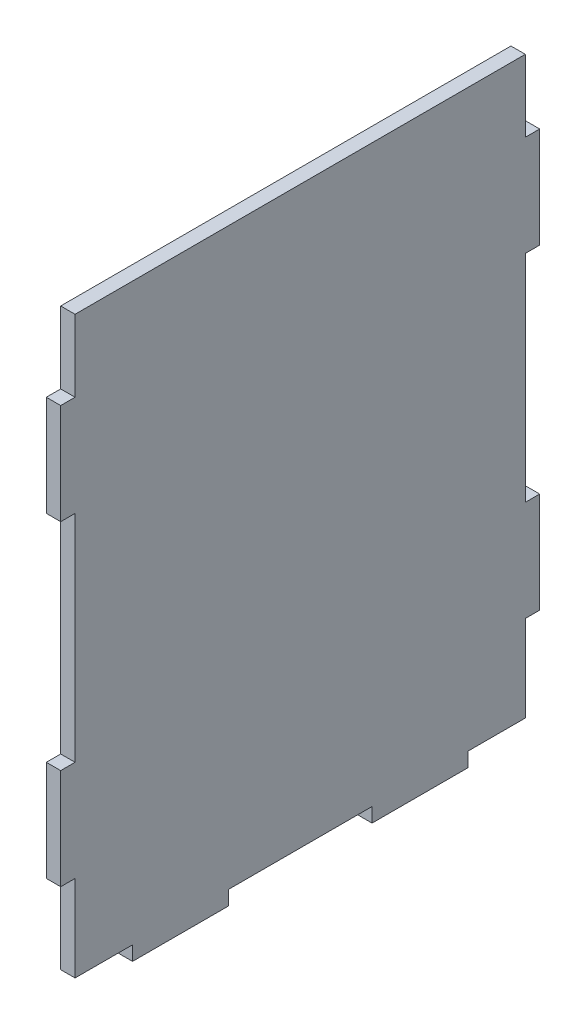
ISO-10303-21;
HEADER;
FILE_DESCRIPTION(('STEP AP214'),'2;1');
FILE_NAME('part.step','',(''),(''),'','','');
FILE_SCHEMA(('AUTOMOTIVE_DESIGN { 1 0 10303 214 1 1 1 1 }'));
ENDSEC;
DATA;
#1=APPLICATION_CONTEXT('core data for automotive mechanical design processes');
#2=APPLICATION_PROTOCOL_DEFINITION('international standard','automotive_design',2000,#1);
#3=PRODUCT_CONTEXT('',#1,'mechanical');
#4=PRODUCT('Part','Part','',(#3));
#5=PRODUCT_RELATED_PRODUCT_CATEGORY('part','',(#4));
#6=PRODUCT_DEFINITION_FORMATION('','',#4);
#7=PRODUCT_DEFINITION_CONTEXT('part definition',#1,'design');
#8=PRODUCT_DEFINITION('design','',#6,#7);
#9=PRODUCT_DEFINITION_SHAPE('','',#8);
#10=(LENGTH_UNIT() NAMED_UNIT(*) SI_UNIT(.MILLI.,.METRE.));
#11=(NAMED_UNIT(*) PLANE_ANGLE_UNIT() SI_UNIT($,.RADIAN.));
#12=(NAMED_UNIT(*) SI_UNIT($,.STERADIAN.) SOLID_ANGLE_UNIT());
#13=UNCERTAINTY_MEASURE_WITH_UNIT(LENGTH_MEASURE(1.E-05),#10,'distance_accuracy_value','');
#14=(GEOMETRIC_REPRESENTATION_CONTEXT(3) GLOBAL_UNCERTAINTY_ASSIGNED_CONTEXT((#13)) GLOBAL_UNIT_ASSIGNED_CONTEXT((#10,
#11,#12)) REPRESENTATION_CONTEXT('',''));
#15=CARTESIAN_POINT('',(0.,0.,0.));
#16=DIRECTION('',(0.,0.,1.));
#17=DIRECTION('',(1.,0.,0.));
#18=AXIS2_PLACEMENT_3D('',#15,#16,#17);
#19=CARTESIAN_POINT('',(3.,-60.,50.));
#20=DIRECTION('',(0.,1.,0.));
#21=DIRECTION('',(0.,0.,1.));
#22=AXIS2_PLACEMENT_3D('',#19,#20,#21);
#23=PLANE('',#22);
#24=DIRECTION('',(0.,0.,-1.));
#25=VECTOR('',#24,1.);
#26=CARTESIAN_POINT('',(3.,-60.,50.));
#27=LINE('',#26,#25);
#28=CARTESIAN_POINT('',(3.,-60.,-35.));
#29=VERTEX_POINT('',#28);
#30=CARTESIAN_POINT('',(3.,-60.,-47.));
#31=VERTEX_POINT('',#30);
#32=EDGE_CURVE('E49',#29,#31,#27,.T.);
#33=ORIENTED_EDGE('',*,*,#32,.F.);
#34=DIRECTION('',(1.,0.,0.));
#35=VECTOR('',#34,1.);
#36=CARTESIAN_POINT('',(0.,-60.,-35.));
#37=LINE('',#36,#35);
#38=CARTESIAN_POINT('',(0.,-60.,-35.));
#39=VERTEX_POINT('',#38);
#40=EDGE_CURVE('E253',#39,#29,#37,.T.);
#41=ORIENTED_EDGE('',*,*,#40,.F.);
#42=DIRECTION('',(0.,0.,-1.));
#43=VECTOR('',#42,1.);
#44=CARTESIAN_POINT('',(0.,-60.,50.));
#45=LINE('',#44,#43);
#46=CARTESIAN_POINT('',(0.,-60.,-47.));
#47=VERTEX_POINT('',#46);
#48=EDGE_CURVE('E428',#39,#47,#45,.T.);
#49=ORIENTED_EDGE('',*,*,#48,.T.);
#50=DIRECTION('',(1.,0.,0.));
#51=VECTOR('',#50,1.);
#52=CARTESIAN_POINT('',(0.,-60.,-47.));
#53=LINE('',#52,#51);
#54=EDGE_CURVE('E323',#47,#31,#53,.T.);
#55=ORIENTED_EDGE('',*,*,#54,.T.);
#56=EDGE_LOOP('',(#33,#41,#49,#55));
#57=FACE_BOUND('',#56,.T.);
#58=ADVANCED_FACE('F32',(#57),#23,.F.);
#59=CARTESIAN_POINT('',(0.,-60.,15.));
#60=VERTEX_POINT('',#59);
#61=CARTESIAN_POINT('',(0.,-60.,-15.));
#62=VERTEX_POINT('',#61);
#63=EDGE_CURVE('E427',#60,#62,#45,.T.);
#64=ORIENTED_EDGE('',*,*,#63,.T.);
#65=DIRECTION('',(1.,0.,0.));
#66=VECTOR('',#65,1.);
#67=CARTESIAN_POINT('',(0.,-60.,-15.));
#68=LINE('',#67,#66);
#69=CARTESIAN_POINT('',(3.,-60.,-15.));
#70=VERTEX_POINT('',#69);
#71=EDGE_CURVE('E57',#62,#70,#68,.T.);
#72=ORIENTED_EDGE('',*,*,#71,.T.);
#73=CARTESIAN_POINT('',(3.,-60.,15.));
#74=VERTEX_POINT('',#73);
#75=EDGE_CURVE('E417',#74,#70,#27,.T.);
#76=ORIENTED_EDGE('',*,*,#75,.F.);
#77=DIRECTION('',(1.,0.,0.));
#78=VECTOR('',#77,1.);
#79=CARTESIAN_POINT('',(0.,-60.,15.));
#80=LINE('',#79,#78);
#81=EDGE_CURVE('E275',#60,#74,#80,.T.);
#82=ORIENTED_EDGE('',*,*,#81,.F.);
#83=EDGE_LOOP('',(#64,#72,#76,#82));
#84=FACE_BOUND('',#83,.T.);
#85=ADVANCED_FACE('F457',(#84),#23,.F.);
#86=CARTESIAN_POINT('',(3.,60.,50.));
#87=DIRECTION('',(0.,0.,-1.));
#88=DIRECTION('',(0.,1.,0.));
#89=AXIS2_PLACEMENT_3D('',#86,#87,#88);
#90=PLANE('',#89);
#91=DIRECTION('',(0.,-1.,0.));
#92=VECTOR('',#91,1.);
#93=CARTESIAN_POINT('',(0.,60.,50.));
#94=LINE('',#93,#92);
#95=CARTESIAN_POINT('',(0.,-21.,50.));
#96=VERTEX_POINT('',#95);
#97=CARTESIAN_POINT('',(0.,-42.,50.));
#98=VERTEX_POINT('',#97);
#99=EDGE_CURVE('E422',#96,#98,#94,.T.);
#100=ORIENTED_EDGE('',*,*,#99,.T.);
#101=DIRECTION('',(1.,0.,0.));
#102=VECTOR('',#101,1.);
#103=CARTESIAN_POINT('',(0.,-42.,50.));
#104=LINE('',#103,#102);
#105=CARTESIAN_POINT('',(3.,-42.,50.));
#106=VERTEX_POINT('',#105);
#107=EDGE_CURVE('E358',#98,#106,#104,.T.);
#108=ORIENTED_EDGE('',*,*,#107,.T.);
#109=DIRECTION('',(0.,-1.,0.));
#110=VECTOR('',#109,1.);
#111=CARTESIAN_POINT('',(3.,60.,50.));
#112=LINE('',#111,#110);
#113=CARTESIAN_POINT('',(3.,-21.,50.));
#114=VERTEX_POINT('',#113);
#115=EDGE_CURVE('E410',#114,#106,#112,.T.);
#116=ORIENTED_EDGE('',*,*,#115,.F.);
#117=DIRECTION('',(1.,0.,0.));
#118=VECTOR('',#117,1.);
#119=CARTESIAN_POINT('',(0.,-21.,50.));
#120=LINE('',#119,#118);
#121=EDGE_CURVE('E301',#96,#114,#120,.T.);
#122=ORIENTED_EDGE('',*,*,#121,.F.);
#123=EDGE_LOOP('',(#100,#108,#116,#122));
#124=FACE_BOUND('',#123,.T.);
#125=ADVANCED_FACE('F480',(#124),#90,.F.);
#126=CARTESIAN_POINT('',(3.,-60.,-50.));
#127=DIRECTION('',(0.,0.,1.));
#128=DIRECTION('',(1.,0.,0.));
#129=AXIS2_PLACEMENT_3D('',#126,#127,#128);
#130=PLANE('',#129);
#131=DIRECTION('',(0.,1.,0.));
#132=VECTOR('',#131,1.);
#133=CARTESIAN_POINT('',(3.,-60.,-50.));
#134=LINE('',#133,#132);
#135=CARTESIAN_POINT('',(3.,-42.,-50.));
#136=VERTEX_POINT('',#135);
#137=CARTESIAN_POINT('',(3.,-21.,-50.));
#138=VERTEX_POINT('',#137);
#139=EDGE_CURVE('E11',#136,#138,#134,.T.);
#140=ORIENTED_EDGE('',*,*,#139,.F.);
#141=DIRECTION('',(1.,0.,0.));
#142=VECTOR('',#141,1.);
#143=CARTESIAN_POINT('',(0.,-42.,-50.));
#144=LINE('',#143,#142);
#145=CARTESIAN_POINT('',(0.,-42.,-50.));
#146=VERTEX_POINT('',#145);
#147=EDGE_CURVE('E316',#146,#136,#144,.T.);
#148=ORIENTED_EDGE('',*,*,#147,.F.);
#149=DIRECTION('',(0.,1.,0.));
#150=VECTOR('',#149,1.);
#151=CARTESIAN_POINT('',(0.,-60.,-50.));
#152=LINE('',#151,#150);
#153=CARTESIAN_POINT('',(0.,-21.,-50.));
#154=VERTEX_POINT('',#153);
#155=EDGE_CURVE('E411',#146,#154,#152,.T.);
#156=ORIENTED_EDGE('',*,*,#155,.T.);
#157=DIRECTION('',(1.,0.,0.));
#158=VECTOR('',#157,1.);
#159=CARTESIAN_POINT('',(0.,-21.,-50.));
#160=LINE('',#159,#158);
#161=EDGE_CURVE('E398',#154,#138,#160,.T.);
#162=ORIENTED_EDGE('',*,*,#161,.T.);
#163=EDGE_LOOP('',(#140,#148,#156,#162));
#164=FACE_BOUND('',#163,.T.);
#165=ADVANCED_FACE('F510',(#164),#130,.F.);
#166=CARTESIAN_POINT('',(3.,60.,-50.));
#167=DIRECTION('',(0.,-1.,0.));
#168=DIRECTION('',(0.,0.,-1.));
#169=AXIS2_PLACEMENT_3D('',#166,#167,#168);
#170=PLANE('',#169);
#171=DIRECTION('',(0.,0.,1.));
#172=VECTOR('',#171,1.);
#173=CARTESIAN_POINT('',(3.,60.,-50.));
#174=LINE('',#173,#172);
#175=CARTESIAN_POINT('',(3.,60.,-47.));
#176=VERTEX_POINT('',#175);
#177=CARTESIAN_POINT('',(3.,60.,47.));
#178=VERTEX_POINT('',#177);
#179=EDGE_CURVE('E407',#176,#178,#174,.T.);
#180=ORIENTED_EDGE('',*,*,#179,.F.);
#181=DIRECTION('',(1.,0.,0.));
#182=VECTOR('',#181,1.);
#183=CARTESIAN_POINT('',(0.,60.,-47.));
#184=LINE('',#183,#182);
#185=CARTESIAN_POINT('',(0.,60.,-47.));
#186=VERTEX_POINT('',#185);
#187=EDGE_CURVE('E336',#186,#176,#184,.T.);
#188=ORIENTED_EDGE('',*,*,#187,.F.);
#189=DIRECTION('',(0.,0.,1.));
#190=VECTOR('',#189,1.);
#191=CARTESIAN_POINT('',(0.,60.,-50.));
#192=LINE('',#191,#190);
#193=CARTESIAN_POINT('',(0.,60.,47.));
#194=VERTEX_POINT('',#193);
#195=EDGE_CURVE('E401',#186,#194,#192,.T.);
#196=ORIENTED_EDGE('',*,*,#195,.T.);
#197=DIRECTION('',(1.,0.,0.));
#198=VECTOR('',#197,1.);
#199=CARTESIAN_POINT('',(0.,60.,47.));
#200=LINE('',#199,#198);
#201=EDGE_CURVE('E340',#194,#178,#200,.T.);
#202=ORIENTED_EDGE('',*,*,#201,.T.);
#203=EDGE_LOOP('',(#180,#188,#196,#202));
#204=FACE_BOUND('',#203,.T.);
#205=ADVANCED_FACE('F34',(#204),#170,.F.);
#206=CARTESIAN_POINT('',(3.,45.,50.));
#207=VERTEX_POINT('',#206);
#208=CARTESIAN_POINT('',(3.,24.,50.));
#209=VERTEX_POINT('',#208);
#210=EDGE_CURVE('E414',#207,#209,#112,.T.);
#211=ORIENTED_EDGE('',*,*,#210,.F.);
#212=DIRECTION('',(1.,0.,0.));
#213=VECTOR('',#212,1.);
#214=CARTESIAN_POINT('',(0.,45.,50.));
#215=LINE('',#214,#213);
#216=CARTESIAN_POINT('',(0.,45.,50.));
#217=VERTEX_POINT('',#216);
#218=EDGE_CURVE('E354',#217,#207,#215,.T.);
#219=ORIENTED_EDGE('',*,*,#218,.F.);
#220=CARTESIAN_POINT('',(0.,24.,50.));
#221=VERTEX_POINT('',#220);
#222=EDGE_CURVE('E424',#217,#221,#94,.T.);
#223=ORIENTED_EDGE('',*,*,#222,.T.);
#224=DIRECTION('',(1.,0.,0.));
#225=VECTOR('',#224,1.);
#226=CARTESIAN_POINT('',(0.,24.,50.));
#227=LINE('',#226,#225);
#228=EDGE_CURVE('E304',#221,#209,#227,.T.);
#229=ORIENTED_EDGE('',*,*,#228,.T.);
#230=EDGE_LOOP('',(#211,#219,#223,#229));
#231=FACE_BOUND('',#230,.T.);
#232=ADVANCED_FACE('F439',(#231),#90,.F.);
#233=CARTESIAN_POINT('',(0.,-60.,47.));
#234=VERTEX_POINT('',#233);
#235=CARTESIAN_POINT('',(0.,-60.,35.));
#236=VERTEX_POINT('',#235);
#237=EDGE_CURVE('E425',#234,#236,#45,.T.);
#238=ORIENTED_EDGE('',*,*,#237,.T.);
#239=DIRECTION('',(1.,0.,0.));
#240=VECTOR('',#239,1.);
#241=CARTESIAN_POINT('',(0.,-60.,35.));
#242=LINE('',#241,#240);
#243=CARTESIAN_POINT('',(3.,-60.,35.));
#244=VERTEX_POINT('',#243);
#245=EDGE_CURVE('E267',#236,#244,#242,.T.);
#246=ORIENTED_EDGE('',*,*,#245,.T.);
#247=CARTESIAN_POINT('',(3.,-60.,47.));
#248=VERTEX_POINT('',#247);
#249=EDGE_CURVE('E415',#248,#244,#27,.T.);
#250=ORIENTED_EDGE('',*,*,#249,.F.);
#251=DIRECTION('',(1.,0.,0.));
#252=VECTOR('',#251,1.);
#253=CARTESIAN_POINT('',(0.,-60.,47.));
#254=LINE('',#253,#252);
#255=EDGE_CURVE('E372',#234,#248,#254,.T.);
#256=ORIENTED_EDGE('',*,*,#255,.F.);
#257=EDGE_LOOP('',(#238,#246,#250,#256));
#258=FACE_BOUND('',#257,.T.);
#259=ADVANCED_FACE('F474',(#258),#23,.F.);
#260=CARTESIAN_POINT('',(0.,24.,-50.));
#261=VERTEX_POINT('',#260);
#262=CARTESIAN_POINT('',(0.,45.,-50.));
#263=VERTEX_POINT('',#262);
#264=EDGE_CURVE('E36',#261,#263,#152,.T.);
#265=ORIENTED_EDGE('',*,*,#264,.T.);
#266=DIRECTION('',(1.,0.,0.));
#267=VECTOR('',#266,1.);
#268=CARTESIAN_POINT('',(0.,45.,-50.));
#269=LINE('',#268,#267);
#270=CARTESIAN_POINT('',(3.,45.,-50.));
#271=VERTEX_POINT('',#270);
#272=EDGE_CURVE('E320',#263,#271,#269,.T.);
#273=ORIENTED_EDGE('',*,*,#272,.T.);
#274=CARTESIAN_POINT('',(3.,24.,-50.));
#275=VERTEX_POINT('',#274);
#276=EDGE_CURVE('E41',#275,#271,#134,.T.);
#277=ORIENTED_EDGE('',*,*,#276,.F.);
#278=DIRECTION('',(1.,0.,0.));
#279=VECTOR('',#278,1.);
#280=CARTESIAN_POINT('',(0.,24.,-50.));
#281=LINE('',#280,#279);
#282=EDGE_CURVE('E391',#261,#275,#281,.T.);
#283=ORIENTED_EDGE('',*,*,#282,.F.);
#284=EDGE_LOOP('',(#265,#273,#277,#283));
#285=FACE_BOUND('',#284,.T.);
#286=ADVANCED_FACE('F504',(#285),#130,.F.);
#287=CARTESIAN_POINT('',(3.,0.,0.));
#288=DIRECTION('',(1.,0.,0.));
#289=DIRECTION('',(0.,0.,-1.));
#290=AXIS2_PLACEMENT_3D('',#287,#288,#289);
#291=PLANE('',#290);
#292=DIRECTION('',(0.,-1.,0.));
#293=VECTOR('',#292,1.);
#294=CARTESIAN_POINT('',(3.,-42.,-47.));
#295=LINE('',#294,#293);
#296=CARTESIAN_POINT('',(3.,-42.,-47.));
#297=VERTEX_POINT('',#296);
#298=EDGE_CURVE('E313',#297,#31,#295,.T.);
#299=ORIENTED_EDGE('',*,*,#298,.F.);
#300=DIRECTION('',(0.,0.,1.));
#301=VECTOR('',#300,1.);
#302=CARTESIAN_POINT('',(3.,-42.,-50.));
#303=LINE('',#302,#301);
#304=EDGE_CURVE('E317',#136,#297,#303,.T.);
#305=ORIENTED_EDGE('',*,*,#304,.F.);
#306=ORIENTED_EDGE('',*,*,#139,.T.);
#307=DIRECTION('',(0.,0.,-1.));
#308=VECTOR('',#307,1.);
#309=CARTESIAN_POINT('',(3.,-21.,-47.));
#310=LINE('',#309,#308);
#311=CARTESIAN_POINT('',(3.,-21.,-47.));
#312=VERTEX_POINT('',#311);
#313=EDGE_CURVE('E385',#312,#138,#310,.T.);
#314=ORIENTED_EDGE('',*,*,#313,.F.);
#315=DIRECTION('',(0.,-1.,0.));
#316=VECTOR('',#315,1.);
#317=CARTESIAN_POINT('',(3.,24.,-47.));
#318=LINE('',#317,#316);
#319=CARTESIAN_POINT('',(3.,24.,-47.));
#320=VERTEX_POINT('',#319);
#321=EDGE_CURVE('E394',#320,#312,#318,.T.);
#322=ORIENTED_EDGE('',*,*,#321,.F.);
#323=DIRECTION('',(0.,0.,1.));
#324=VECTOR('',#323,1.);
#325=CARTESIAN_POINT('',(3.,24.,-50.));
#326=LINE('',#325,#324);
#327=EDGE_CURVE('E325',#275,#320,#326,.T.);
#328=ORIENTED_EDGE('',*,*,#327,.F.);
#329=ORIENTED_EDGE('',*,*,#276,.T.);
#330=DIRECTION('',(0.,0.,-1.));
#331=VECTOR('',#330,1.);
#332=CARTESIAN_POINT('',(3.,45.,-47.));
#333=LINE('',#332,#331);
#334=CARTESIAN_POINT('',(3.,45.,-47.));
#335=VERTEX_POINT('',#334);
#336=EDGE_CURVE('E333',#335,#271,#333,.T.);
#337=ORIENTED_EDGE('',*,*,#336,.F.);
#338=DIRECTION('',(0.,-1.,0.));
#339=VECTOR('',#338,1.);
#340=CARTESIAN_POINT('',(3.,60.,-47.));
#341=LINE('',#340,#339);
#342=EDGE_CURVE('E337',#176,#335,#341,.T.);
#343=ORIENTED_EDGE('',*,*,#342,.F.);
#344=ORIENTED_EDGE('',*,*,#179,.T.);
#345=DIRECTION('',(0.,1.,0.));
#346=VECTOR('',#345,1.);
#347=CARTESIAN_POINT('',(3.,60.,47.));
#348=LINE('',#347,#346);
#349=CARTESIAN_POINT('',(3.,45.,47.));
#350=VERTEX_POINT('',#349);
#351=EDGE_CURVE('E351',#350,#178,#348,.T.);
#352=ORIENTED_EDGE('',*,*,#351,.F.);
#353=DIRECTION('',(0.,0.,-1.));
#354=VECTOR('',#353,1.);
#355=CARTESIAN_POINT('',(3.,45.,47.));
#356=LINE('',#355,#354);
#357=EDGE_CURVE('E355',#207,#350,#356,.T.);
#358=ORIENTED_EDGE('',*,*,#357,.F.);
#359=ORIENTED_EDGE('',*,*,#210,.T.);
#360=DIRECTION('',(0.,0.,1.));
#361=VECTOR('',#360,1.);
#362=CARTESIAN_POINT('',(3.,24.,50.));
#363=LINE('',#362,#361);
#364=CARTESIAN_POINT('',(3.,24.,47.));
#365=VERTEX_POINT('',#364);
#366=EDGE_CURVE('E288',#365,#209,#363,.T.);
#367=ORIENTED_EDGE('',*,*,#366,.F.);
#368=DIRECTION('',(0.,1.,0.));
#369=VECTOR('',#368,1.);
#370=CARTESIAN_POINT('',(3.,24.,47.));
#371=LINE('',#370,#369);
#372=CARTESIAN_POINT('',(3.,-21.,47.));
#373=VERTEX_POINT('',#372);
#374=EDGE_CURVE('E297',#373,#365,#371,.T.);
#375=ORIENTED_EDGE('',*,*,#374,.F.);
#376=DIRECTION('',(0.,0.,-1.));
#377=VECTOR('',#376,1.);
#378=CARTESIAN_POINT('',(3.,-21.,47.));
#379=LINE('',#378,#377);
#380=EDGE_CURVE('E277',#114,#373,#379,.T.);
#381=ORIENTED_EDGE('',*,*,#380,.F.);
#382=ORIENTED_EDGE('',*,*,#115,.T.);
#383=DIRECTION('',(0.,0.,1.));
#384=VECTOR('',#383,1.);
#385=CARTESIAN_POINT('',(3.,-42.,50.));
#386=LINE('',#385,#384);
#387=CARTESIAN_POINT('',(3.,-42.,47.));
#388=VERTEX_POINT('',#387);
#389=EDGE_CURVE('E369',#388,#106,#386,.T.);
#390=ORIENTED_EDGE('',*,*,#389,.F.);
#391=DIRECTION('',(0.,1.,0.));
#392=VECTOR('',#391,1.);
#393=CARTESIAN_POINT('',(3.,-42.,47.));
#394=LINE('',#393,#392);
#395=EDGE_CURVE('E303',#248,#388,#394,.T.);
#396=ORIENTED_EDGE('',*,*,#395,.F.);
#397=ORIENTED_EDGE('',*,*,#249,.T.);
#398=DIRECTION('',(0.,-1.,0.));
#399=VECTOR('',#398,1.);
#400=CARTESIAN_POINT('',(3.,-60.,35.));
#401=LINE('',#400,#399);
#402=CARTESIAN_POINT('',(3.,-63.,35.));
#403=VERTEX_POINT('',#402);
#404=EDGE_CURVE('E255',#244,#403,#401,.T.);
#405=ORIENTED_EDGE('',*,*,#404,.T.);
#406=DIRECTION('',(0.,0.,-1.));
#407=VECTOR('',#406,1.);
#408=CARTESIAN_POINT('',(3.,-63.,35.));
#409=LINE('',#408,#407);
#410=CARTESIAN_POINT('',(3.,-63.,15.));
#411=VERTEX_POINT('',#410);
#412=EDGE_CURVE('E270',#403,#411,#409,.T.);
#413=ORIENTED_EDGE('',*,*,#412,.T.);
#414=DIRECTION('',(0.,1.,0.));
#415=VECTOR('',#414,1.);
#416=CARTESIAN_POINT('',(3.,-63.,15.));
#417=LINE('',#416,#415);
#418=EDGE_CURVE('E262',#411,#74,#417,.T.);
#419=ORIENTED_EDGE('',*,*,#418,.T.);
#420=ORIENTED_EDGE('',*,*,#75,.T.);
#421=DIRECTION('',(0.,-1.,0.));
#422=VECTOR('',#421,1.);
#423=CARTESIAN_POINT('',(3.,-60.,-15.));
#424=LINE('',#423,#422);
#425=CARTESIAN_POINT('',(3.,-63.,-15.));
#426=VERTEX_POINT('',#425);
#427=EDGE_CURVE('E250',#70,#426,#424,.T.);
#428=ORIENTED_EDGE('',*,*,#427,.T.);
#429=DIRECTION('',(0.,0.,-1.));
#430=VECTOR('',#429,1.);
#431=CARTESIAN_POINT('',(3.,-63.,-15.));
#432=LINE('',#431,#430);
#433=CARTESIAN_POINT('',(3.,-63.,-35.));
#434=VERTEX_POINT('',#433);
#435=EDGE_CURVE('E227',#426,#434,#432,.T.);
#436=ORIENTED_EDGE('',*,*,#435,.T.);
#437=DIRECTION('',(0.,1.,0.));
#438=VECTOR('',#437,1.);
#439=CARTESIAN_POINT('',(3.,-63.,-35.));
#440=LINE('',#439,#438);
#441=EDGE_CURVE('E244',#434,#29,#440,.T.);
#442=ORIENTED_EDGE('',*,*,#441,.T.);
#443=ORIENTED_EDGE('',*,*,#32,.T.);
#444=EDGE_LOOP('',(#299,#305,#306,#314,#322,#328,#329,#337,#343,#344,#352,#358,#359,#367,#375,
#381,#382,#390,#396,#397,#405,#413,#419,#420,#428,#436,#442,#443));
#445=FACE_BOUND('',#444,.T.);
#446=ADVANCED_FACE('F452',(#445),#291,.T.);
#447=CARTESIAN_POINT('',(0.,0.,0.));
#448=DIRECTION('',(1.,0.,0.));
#449=DIRECTION('',(0.,0.,-1.));
#450=AXIS2_PLACEMENT_3D('',#447,#448,#449);
#451=PLANE('',#450);
#452=DIRECTION('',(0.,0.,1.));
#453=VECTOR('',#452,1.);
#454=CARTESIAN_POINT('',(0.,-42.,-50.));
#455=LINE('',#454,#453);
#456=CARTESIAN_POINT('',(0.,-42.,-47.));
#457=VERTEX_POINT('',#456);
#458=EDGE_CURVE('E310',#146,#457,#455,.T.);
#459=ORIENTED_EDGE('',*,*,#458,.T.);
#460=DIRECTION('',(0.,-1.,0.));
#461=VECTOR('',#460,1.);
#462=CARTESIAN_POINT('',(0.,-42.,-47.));
#463=LINE('',#462,#461);
#464=EDGE_CURVE('E312',#457,#47,#463,.T.);
#465=ORIENTED_EDGE('',*,*,#464,.T.);
#466=ORIENTED_EDGE('',*,*,#48,.F.);
#467=DIRECTION('',(0.,1.,0.));
#468=VECTOR('',#467,1.);
#469=CARTESIAN_POINT('',(0.,-63.,-35.));
#470=LINE('',#469,#468);
#471=CARTESIAN_POINT('',(0.,-63.,-35.));
#472=VERTEX_POINT('',#471);
#473=EDGE_CURVE('E241',#472,#39,#470,.T.);
#474=ORIENTED_EDGE('',*,*,#473,.F.);
#475=DIRECTION('',(0.,0.,-1.));
#476=VECTOR('',#475,1.);
#477=CARTESIAN_POINT('',(0.,-63.,-15.));
#478=LINE('',#477,#476);
#479=CARTESIAN_POINT('',(0.,-63.,-15.));
#480=VERTEX_POINT('',#479);
#481=EDGE_CURVE('E224',#480,#472,#478,.T.);
#482=ORIENTED_EDGE('',*,*,#481,.F.);
#483=DIRECTION('',(0.,-1.,0.));
#484=VECTOR('',#483,1.);
#485=CARTESIAN_POINT('',(0.,-60.,-15.));
#486=LINE('',#485,#484);
#487=EDGE_CURVE('E239',#62,#480,#486,.T.);
#488=ORIENTED_EDGE('',*,*,#487,.F.);
#489=ORIENTED_EDGE('',*,*,#63,.F.);
#490=DIRECTION('',(0.,1.,0.));
#491=VECTOR('',#490,1.);
#492=CARTESIAN_POINT('',(0.,-63.,15.));
#493=LINE('',#492,#491);
#494=CARTESIAN_POINT('',(0.,-63.,15.));
#495=VERTEX_POINT('',#494);
#496=EDGE_CURVE('E265',#495,#60,#493,.T.);
#497=ORIENTED_EDGE('',*,*,#496,.F.);
#498=DIRECTION('',(0.,0.,-1.));
#499=VECTOR('',#498,1.);
#500=CARTESIAN_POINT('',(0.,-63.,35.));
#501=LINE('',#500,#499);
#502=CARTESIAN_POINT('',(0.,-63.,35.));
#503=VERTEX_POINT('',#502);
#504=EDGE_CURVE('E261',#503,#495,#501,.T.);
#505=ORIENTED_EDGE('',*,*,#504,.F.);
#506=DIRECTION('',(0.,-1.,0.));
#507=VECTOR('',#506,1.);
#508=CARTESIAN_POINT('',(0.,-60.,35.));
#509=LINE('',#508,#507);
#510=EDGE_CURVE('E258',#236,#503,#509,.T.);
#511=ORIENTED_EDGE('',*,*,#510,.F.);
#512=ORIENTED_EDGE('',*,*,#237,.F.);
#513=DIRECTION('',(0.,1.,0.));
#514=VECTOR('',#513,1.);
#515=CARTESIAN_POINT('',(0.,-42.,47.));
#516=LINE('',#515,#514);
#517=CARTESIAN_POINT('',(0.,-42.,47.));
#518=VERTEX_POINT('',#517);
#519=EDGE_CURVE('E365',#234,#518,#516,.T.);
#520=ORIENTED_EDGE('',*,*,#519,.T.);
#521=DIRECTION('',(0.,0.,1.));
#522=VECTOR('',#521,1.);
#523=CARTESIAN_POINT('',(0.,-42.,50.));
#524=LINE('',#523,#522);
#525=EDGE_CURVE('E368',#518,#98,#524,.T.);
#526=ORIENTED_EDGE('',*,*,#525,.T.);
#527=ORIENTED_EDGE('',*,*,#99,.F.);
#528=DIRECTION('',(0.,0.,-1.));
#529=VECTOR('',#528,1.);
#530=CARTESIAN_POINT('',(0.,-21.,47.));
#531=LINE('',#530,#529);
#532=CARTESIAN_POINT('',(0.,-21.,47.));
#533=VERTEX_POINT('',#532);
#534=EDGE_CURVE('E284',#96,#533,#531,.T.);
#535=ORIENTED_EDGE('',*,*,#534,.T.);
#536=DIRECTION('',(0.,1.,0.));
#537=VECTOR('',#536,1.);
#538=CARTESIAN_POINT('',(0.,24.,47.));
#539=LINE('',#538,#537);
#540=CARTESIAN_POINT('',(0.,24.,47.));
#541=VERTEX_POINT('',#540);
#542=EDGE_CURVE('E287',#533,#541,#539,.T.);
#543=ORIENTED_EDGE('',*,*,#542,.T.);
#544=DIRECTION('',(0.,0.,1.));
#545=VECTOR('',#544,1.);
#546=CARTESIAN_POINT('',(0.,24.,50.));
#547=LINE('',#546,#545);
#548=EDGE_CURVE('E291',#541,#221,#547,.T.);
#549=ORIENTED_EDGE('',*,*,#548,.T.);
#550=ORIENTED_EDGE('',*,*,#222,.F.);
#551=DIRECTION('',(0.,0.,-1.));
#552=VECTOR('',#551,1.);
#553=CARTESIAN_POINT('',(0.,45.,47.));
#554=LINE('',#553,#552);
#555=CARTESIAN_POINT('',(0.,45.,47.));
#556=VERTEX_POINT('',#555);
#557=EDGE_CURVE('E347',#217,#556,#554,.T.);
#558=ORIENTED_EDGE('',*,*,#557,.T.);
#559=DIRECTION('',(0.,1.,0.));
#560=VECTOR('',#559,1.);
#561=CARTESIAN_POINT('',(0.,60.,47.));
#562=LINE('',#561,#560);
#563=EDGE_CURVE('E350',#556,#194,#562,.T.);
#564=ORIENTED_EDGE('',*,*,#563,.T.);
#565=ORIENTED_EDGE('',*,*,#195,.F.);
#566=DIRECTION('',(0.,-1.,0.));
#567=VECTOR('',#566,1.);
#568=CARTESIAN_POINT('',(0.,60.,-47.));
#569=LINE('',#568,#567);
#570=CARTESIAN_POINT('',(0.,45.,-47.));
#571=VERTEX_POINT('',#570);
#572=EDGE_CURVE('E329',#186,#571,#569,.T.);
#573=ORIENTED_EDGE('',*,*,#572,.T.);
#574=DIRECTION('',(0.,0.,-1.));
#575=VECTOR('',#574,1.);
#576=CARTESIAN_POINT('',(0.,45.,-47.));
#577=LINE('',#576,#575);
#578=EDGE_CURVE('E332',#571,#263,#577,.T.);
#579=ORIENTED_EDGE('',*,*,#578,.T.);
#580=ORIENTED_EDGE('',*,*,#264,.F.);
#581=DIRECTION('',(0.,0.,1.));
#582=VECTOR('',#581,1.);
#583=CARTESIAN_POINT('',(0.,24.,-50.));
#584=LINE('',#583,#582);
#585=CARTESIAN_POINT('',(0.,24.,-47.));
#586=VERTEX_POINT('',#585);
#587=EDGE_CURVE('E381',#261,#586,#584,.T.);
#588=ORIENTED_EDGE('',*,*,#587,.T.);
#589=DIRECTION('',(0.,-1.,0.));
#590=VECTOR('',#589,1.);
#591=CARTESIAN_POINT('',(0.,24.,-47.));
#592=LINE('',#591,#590);
#593=CARTESIAN_POINT('',(0.,-21.,-47.));
#594=VERTEX_POINT('',#593);
#595=EDGE_CURVE('E384',#586,#594,#592,.T.);
#596=ORIENTED_EDGE('',*,*,#595,.T.);
#597=DIRECTION('',(0.,0.,-1.));
#598=VECTOR('',#597,1.);
#599=CARTESIAN_POINT('',(0.,-21.,-47.));
#600=LINE('',#599,#598);
#601=EDGE_CURVE('E388',#594,#154,#600,.T.);
#602=ORIENTED_EDGE('',*,*,#601,.T.);
#603=ORIENTED_EDGE('',*,*,#155,.F.);
#604=EDGE_LOOP('',(#459,#465,#466,#474,#482,#488,#489,#497,#505,#511,#512,#520,#526,#527,#535,
#543,#549,#550,#558,#564,#565,#573,#579,#580,#588,#596,#602,#603));
#605=FACE_BOUND('',#604,.T.);
#606=ADVANCED_FACE('F237',(#605),#451,.F.);
#607=CARTESIAN_POINT('',(0.,-21.,-47.));
#608=DIRECTION('',(0.,-1.,0.));
#609=DIRECTION('',(0.,0.,-1.));
#610=AXIS2_PLACEMENT_3D('',#607,#608,#609);
#611=PLANE('',#610);
#612=ORIENTED_EDGE('',*,*,#313,.T.);
#613=ORIENTED_EDGE('',*,*,#161,.F.);
#614=ORIENTED_EDGE('',*,*,#601,.F.);
#615=DIRECTION('',(1.,0.,0.));
#616=VECTOR('',#615,1.);
#617=CARTESIAN_POINT('',(0.,-21.,-47.));
#618=LINE('',#617,#616);
#619=EDGE_CURVE('E402',#594,#312,#618,.T.);
#620=ORIENTED_EDGE('',*,*,#619,.T.);
#621=EDGE_LOOP('',(#612,#613,#614,#620));
#622=FACE_BOUND('',#621,.T.);
#623=ADVANCED_FACE('F526',(#622),#611,.F.);
#624=CARTESIAN_POINT('',(0.,24.,-47.));
#625=DIRECTION('',(0.,0.,1.));
#626=DIRECTION('',(1.,0.,0.));
#627=AXIS2_PLACEMENT_3D('',#624,#625,#626);
#628=PLANE('',#627);
#629=ORIENTED_EDGE('',*,*,#321,.T.);
#630=ORIENTED_EDGE('',*,*,#619,.F.);
#631=ORIENTED_EDGE('',*,*,#595,.F.);
#632=DIRECTION('',(1.,0.,0.));
#633=VECTOR('',#632,1.);
#634=CARTESIAN_POINT('',(0.,24.,-47.));
#635=LINE('',#634,#633);
#636=EDGE_CURVE('E404',#586,#320,#635,.T.);
#637=ORIENTED_EDGE('',*,*,#636,.T.);
#638=EDGE_LOOP('',(#629,#630,#631,#637));
#639=FACE_BOUND('',#638,.T.);
#640=ADVANCED_FACE('F492',(#639),#628,.F.);
#641=CARTESIAN_POINT('',(0.,24.,-50.));
#642=DIRECTION('',(0.,1.,0.));
#643=DIRECTION('',(0.,0.,1.));
#644=AXIS2_PLACEMENT_3D('',#641,#642,#643);
#645=PLANE('',#644);
#646=ORIENTED_EDGE('',*,*,#327,.T.);
#647=ORIENTED_EDGE('',*,*,#636,.F.);
#648=ORIENTED_EDGE('',*,*,#587,.F.);
#649=ORIENTED_EDGE('',*,*,#282,.T.);
#650=EDGE_LOOP('',(#646,#647,#648,#649));
#651=FACE_BOUND('',#650,.T.);
#652=ADVANCED_FACE('F485',(#651),#645,.F.);
#653=CARTESIAN_POINT('',(0.,-21.,47.));
#654=DIRECTION('',(0.,-1.,0.));
#655=DIRECTION('',(0.,0.,-1.));
#656=AXIS2_PLACEMENT_3D('',#653,#654,#655);
#657=PLANE('',#656);
#658=ORIENTED_EDGE('',*,*,#380,.T.);
#659=DIRECTION('',(1.,0.,0.));
#660=VECTOR('',#659,1.);
#661=CARTESIAN_POINT('',(0.,-21.,47.));
#662=LINE('',#661,#660);
#663=EDGE_CURVE('E294',#533,#373,#662,.T.);
#664=ORIENTED_EDGE('',*,*,#663,.F.);
#665=ORIENTED_EDGE('',*,*,#534,.F.);
#666=ORIENTED_EDGE('',*,*,#121,.T.);
#667=EDGE_LOOP('',(#658,#664,#665,#666));
#668=FACE_BOUND('',#667,.T.);
#669=ADVANCED_FACE('F483',(#668),#657,.F.);
#670=CARTESIAN_POINT('',(0.,24.,50.));
#671=DIRECTION('',(0.,1.,0.));
#672=DIRECTION('',(0.,0.,1.));
#673=AXIS2_PLACEMENT_3D('',#670,#671,#672);
#674=PLANE('',#673);
#675=ORIENTED_EDGE('',*,*,#366,.T.);
#676=ORIENTED_EDGE('',*,*,#228,.F.);
#677=ORIENTED_EDGE('',*,*,#548,.F.);
#678=DIRECTION('',(1.,0.,0.));
#679=VECTOR('',#678,1.);
#680=CARTESIAN_POINT('',(0.,24.,47.));
#681=LINE('',#680,#679);
#682=EDGE_CURVE('E307',#541,#365,#681,.T.);
#683=ORIENTED_EDGE('',*,*,#682,.T.);
#684=EDGE_LOOP('',(#675,#676,#677,#683));
#685=FACE_BOUND('',#684,.T.);
#686=ADVANCED_FACE('F444',(#685),#674,.F.);
#687=CARTESIAN_POINT('',(0.,24.,47.));
#688=DIRECTION('',(0.,0.,-1.));
#689=DIRECTION('',(-1.,0.,0.));
#690=AXIS2_PLACEMENT_3D('',#687,#688,#689);
#691=PLANE('',#690);
#692=ORIENTED_EDGE('',*,*,#374,.T.);
#693=ORIENTED_EDGE('',*,*,#682,.F.);
#694=ORIENTED_EDGE('',*,*,#542,.F.);
#695=ORIENTED_EDGE('',*,*,#663,.T.);
#696=EDGE_LOOP('',(#692,#693,#694,#695));
#697=FACE_BOUND('',#696,.T.);
#698=ADVANCED_FACE('F446',(#697),#691,.F.);
#699=CARTESIAN_POINT('',(0.,-42.,50.));
#700=DIRECTION('',(0.,1.,0.));
#701=DIRECTION('',(0.,0.,1.));
#702=AXIS2_PLACEMENT_3D('',#699,#700,#701);
#703=PLANE('',#702);
#704=ORIENTED_EDGE('',*,*,#389,.T.);
#705=ORIENTED_EDGE('',*,*,#107,.F.);
#706=ORIENTED_EDGE('',*,*,#525,.F.);
#707=DIRECTION('',(1.,0.,0.));
#708=VECTOR('',#707,1.);
#709=CARTESIAN_POINT('',(0.,-42.,47.));
#710=LINE('',#709,#708);
#711=EDGE_CURVE('E378',#518,#388,#710,.T.);
#712=ORIENTED_EDGE('',*,*,#711,.T.);
#713=EDGE_LOOP('',(#704,#705,#706,#712));
#714=FACE_BOUND('',#713,.T.);
#715=ADVANCED_FACE('F478',(#714),#703,.F.);
#716=CARTESIAN_POINT('',(0.,-42.,47.));
#717=DIRECTION('',(0.,0.,-1.));
#718=DIRECTION('',(0.,1.,0.));
#719=AXIS2_PLACEMENT_3D('',#716,#717,#718);
#720=PLANE('',#719);
#721=ORIENTED_EDGE('',*,*,#395,.T.);
#722=ORIENTED_EDGE('',*,*,#711,.F.);
#723=ORIENTED_EDGE('',*,*,#519,.F.);
#724=ORIENTED_EDGE('',*,*,#255,.T.);
#725=EDGE_LOOP('',(#721,#722,#723,#724));
#726=FACE_BOUND('',#725,.T.);
#727=ADVANCED_FACE('F471',(#726),#720,.F.);
#728=CARTESIAN_POINT('',(0.,60.,47.));
#729=DIRECTION('',(0.,0.,-1.));
#730=DIRECTION('',(0.,1.,0.));
#731=AXIS2_PLACEMENT_3D('',#728,#729,#730);
#732=PLANE('',#731);
#733=ORIENTED_EDGE('',*,*,#351,.T.);
#734=ORIENTED_EDGE('',*,*,#201,.F.);
#735=ORIENTED_EDGE('',*,*,#563,.F.);
#736=DIRECTION('',(1.,0.,0.));
#737=VECTOR('',#736,1.);
#738=CARTESIAN_POINT('',(0.,45.,47.));
#739=LINE('',#738,#737);
#740=EDGE_CURVE('E362',#556,#350,#739,.T.);
#741=ORIENTED_EDGE('',*,*,#740,.T.);
#742=EDGE_LOOP('',(#733,#734,#735,#741));
#743=FACE_BOUND('',#742,.T.);
#744=ADVANCED_FACE('F537',(#743),#732,.F.);
#745=CARTESIAN_POINT('',(0.,45.,47.));
#746=DIRECTION('',(0.,-1.,0.));
#747=DIRECTION('',(0.,0.,-1.));
#748=AXIS2_PLACEMENT_3D('',#745,#746,#747);
#749=PLANE('',#748);
#750=ORIENTED_EDGE('',*,*,#357,.T.);
#751=ORIENTED_EDGE('',*,*,#740,.F.);
#752=ORIENTED_EDGE('',*,*,#557,.F.);
#753=ORIENTED_EDGE('',*,*,#218,.T.);
#754=EDGE_LOOP('',(#750,#751,#752,#753));
#755=FACE_BOUND('',#754,.T.);
#756=ADVANCED_FACE('F540',(#755),#749,.F.);
#757=CARTESIAN_POINT('',(0.,45.,-47.));
#758=DIRECTION('',(0.,-1.,0.));
#759=DIRECTION('',(0.,0.,-1.));
#760=AXIS2_PLACEMENT_3D('',#757,#758,#759);
#761=PLANE('',#760);
#762=ORIENTED_EDGE('',*,*,#336,.T.);
#763=ORIENTED_EDGE('',*,*,#272,.F.);
#764=ORIENTED_EDGE('',*,*,#578,.F.);
#765=DIRECTION('',(1.,0.,0.));
#766=VECTOR('',#765,1.);
#767=CARTESIAN_POINT('',(0.,45.,-47.));
#768=LINE('',#767,#766);
#769=EDGE_CURVE('E344',#571,#335,#768,.T.);
#770=ORIENTED_EDGE('',*,*,#769,.T.);
#771=EDGE_LOOP('',(#762,#763,#764,#770));
#772=FACE_BOUND('',#771,.T.);
#773=ADVANCED_FACE('F543',(#772),#761,.F.);
#774=CARTESIAN_POINT('',(0.,60.,-47.));
#775=DIRECTION('',(0.,0.,1.));
#776=DIRECTION('',(0.,-1.,0.));
#777=AXIS2_PLACEMENT_3D('',#774,#775,#776);
#778=PLANE('',#777);
#779=ORIENTED_EDGE('',*,*,#342,.T.);
#780=ORIENTED_EDGE('',*,*,#769,.F.);
#781=ORIENTED_EDGE('',*,*,#572,.F.);
#782=ORIENTED_EDGE('',*,*,#187,.T.);
#783=EDGE_LOOP('',(#779,#780,#781,#782));
#784=FACE_BOUND('',#783,.T.);
#785=ADVANCED_FACE('F548',(#784),#778,.F.);
#786=CARTESIAN_POINT('',(0.,-42.,-47.));
#787=DIRECTION('',(0.,0.,1.));
#788=DIRECTION('',(1.,0.,0.));
#789=AXIS2_PLACEMENT_3D('',#786,#787,#788);
#790=PLANE('',#789);
#791=ORIENTED_EDGE('',*,*,#298,.T.);
#792=ORIENTED_EDGE('',*,*,#54,.F.);
#793=ORIENTED_EDGE('',*,*,#464,.F.);
#794=DIRECTION('',(1.,0.,0.));
#795=VECTOR('',#794,1.);
#796=CARTESIAN_POINT('',(0.,-42.,-47.));
#797=LINE('',#796,#795);
#798=EDGE_CURVE('E326',#457,#297,#797,.T.);
#799=ORIENTED_EDGE('',*,*,#798,.T.);
#800=EDGE_LOOP('',(#791,#792,#793,#799));
#801=FACE_BOUND('',#800,.T.);
#802=ADVANCED_FACE('F551',(#801),#790,.F.);
#803=CARTESIAN_POINT('',(0.,-42.,-50.));
#804=DIRECTION('',(0.,1.,0.));
#805=DIRECTION('',(0.,0.,1.));
#806=AXIS2_PLACEMENT_3D('',#803,#804,#805);
#807=PLANE('',#806);
#808=ORIENTED_EDGE('',*,*,#304,.T.);
#809=ORIENTED_EDGE('',*,*,#798,.F.);
#810=ORIENTED_EDGE('',*,*,#458,.F.);
#811=ORIENTED_EDGE('',*,*,#147,.T.);
#812=EDGE_LOOP('',(#808,#809,#810,#811));
#813=FACE_BOUND('',#812,.T.);
#814=ADVANCED_FACE('F556',(#813),#807,.F.);
#815=CARTESIAN_POINT('',(0.,-63.,15.));
#816=DIRECTION('',(0.,0.,-1.));
#817=DIRECTION('',(-1.,0.,0.));
#818=AXIS2_PLACEMENT_3D('',#815,#816,#817);
#819=PLANE('',#818);
#820=ORIENTED_EDGE('',*,*,#418,.F.);
#821=DIRECTION('',(1.,0.,0.));
#822=VECTOR('',#821,1.);
#823=CARTESIAN_POINT('',(0.,-63.,15.));
#824=LINE('',#823,#822);
#825=EDGE_CURVE('E278',#495,#411,#824,.T.);
#826=ORIENTED_EDGE('',*,*,#825,.F.);
#827=ORIENTED_EDGE('',*,*,#496,.T.);
#828=ORIENTED_EDGE('',*,*,#81,.T.);
#829=EDGE_LOOP('',(#820,#826,#827,#828));
#830=FACE_BOUND('',#829,.T.);
#831=ADVANCED_FACE('F462',(#830),#819,.T.);
#832=CARTESIAN_POINT('',(0.,-63.,35.));
#833=DIRECTION('',(0.,-1.,0.));
#834=DIRECTION('',(0.,0.,-1.));
#835=AXIS2_PLACEMENT_3D('',#832,#833,#834);
#836=PLANE('',#835);
#837=ORIENTED_EDGE('',*,*,#412,.F.);
#838=DIRECTION('',(1.,0.,0.));
#839=VECTOR('',#838,1.);
#840=CARTESIAN_POINT('',(0.,-63.,35.));
#841=LINE('',#840,#839);
#842=EDGE_CURVE('E280',#503,#403,#841,.T.);
#843=ORIENTED_EDGE('',*,*,#842,.F.);
#844=ORIENTED_EDGE('',*,*,#504,.T.);
#845=ORIENTED_EDGE('',*,*,#825,.T.);
#846=EDGE_LOOP('',(#837,#843,#844,#845));
#847=FACE_BOUND('',#846,.T.);
#848=ADVANCED_FACE('F465',(#847),#836,.T.);
#849=CARTESIAN_POINT('',(0.,-60.,35.));
#850=DIRECTION('',(0.,0.,1.));
#851=DIRECTION('',(1.,0.,0.));
#852=AXIS2_PLACEMENT_3D('',#849,#850,#851);
#853=PLANE('',#852);
#854=ORIENTED_EDGE('',*,*,#404,.F.);
#855=ORIENTED_EDGE('',*,*,#245,.F.);
#856=ORIENTED_EDGE('',*,*,#510,.T.);
#857=ORIENTED_EDGE('',*,*,#842,.T.);
#858=EDGE_LOOP('',(#854,#855,#856,#857));
#859=FACE_BOUND('',#858,.T.);
#860=ADVANCED_FACE('F467',(#859),#853,.T.);
#861=CARTESIAN_POINT('',(0.,-63.,-35.));
#862=DIRECTION('',(0.,0.,-1.));
#863=DIRECTION('',(-1.,0.,0.));
#864=AXIS2_PLACEMENT_3D('',#861,#862,#863);
#865=PLANE('',#864);
#866=ORIENTED_EDGE('',*,*,#441,.F.);
#867=DIRECTION('',(1.,0.,0.));
#868=VECTOR('',#867,1.);
#869=CARTESIAN_POINT('',(0.,-63.,-35.));
#870=LINE('',#869,#868);
#871=EDGE_CURVE('E232',#472,#434,#870,.T.);
#872=ORIENTED_EDGE('',*,*,#871,.F.);
#873=ORIENTED_EDGE('',*,*,#473,.T.);
#874=ORIENTED_EDGE('',*,*,#40,.T.);
#875=EDGE_LOOP('',(#866,#872,#873,#874));
#876=FACE_BOUND('',#875,.T.);
#877=ADVANCED_FACE('F585',(#876),#865,.T.);
#878=CARTESIAN_POINT('',(0.,-63.,-15.));
#879=DIRECTION('',(0.,-1.,0.));
#880=DIRECTION('',(0.,0.,-1.));
#881=AXIS2_PLACEMENT_3D('',#878,#879,#880);
#882=PLANE('',#881);
#883=ORIENTED_EDGE('',*,*,#435,.F.);
#884=DIRECTION('',(1.,0.,0.));
#885=VECTOR('',#884,1.);
#886=CARTESIAN_POINT('',(0.,-63.,-15.));
#887=LINE('',#886,#885);
#888=EDGE_CURVE('E221',#480,#426,#887,.T.);
#889=ORIENTED_EDGE('',*,*,#888,.F.);
#890=ORIENTED_EDGE('',*,*,#481,.T.);
#891=ORIENTED_EDGE('',*,*,#871,.T.);
#892=EDGE_LOOP('',(#883,#889,#890,#891));
#893=FACE_BOUND('',#892,.T.);
#894=ADVANCED_FACE('F223',(#893),#882,.T.);
#895=CARTESIAN_POINT('',(0.,-60.,-15.));
#896=DIRECTION('',(0.,0.,1.));
#897=DIRECTION('',(0.,-1.,0.));
#898=AXIS2_PLACEMENT_3D('',#895,#896,#897);
#899=PLANE('',#898);
#900=ORIENTED_EDGE('',*,*,#427,.F.);
#901=ORIENTED_EDGE('',*,*,#71,.F.);
#902=ORIENTED_EDGE('',*,*,#487,.T.);
#903=ORIENTED_EDGE('',*,*,#888,.T.);
#904=EDGE_LOOP('',(#900,#901,#902,#903));
#905=FACE_BOUND('',#904,.T.);
#906=ADVANCED_FACE('F243',(#905),#899,.T.);
#907=CLOSED_SHELL('',(#58,#85,#125,#165,#205,#232,#259,#286,#446,#606,#623,#640,#652,#669,#686,
#698,#715,#727,#744,#756,#773,#785,#802,#814,#831,#848,#860,#877,#894,#906));
#908=MANIFOLD_SOLID_BREP('B2',#907);
#909=ADVANCED_BREP_SHAPE_REPRESENTATION('',(#18,#908),#14);
#910=SHAPE_DEFINITION_REPRESENTATION(#9,#909);
ENDSEC;
END-ISO-10303-21;
